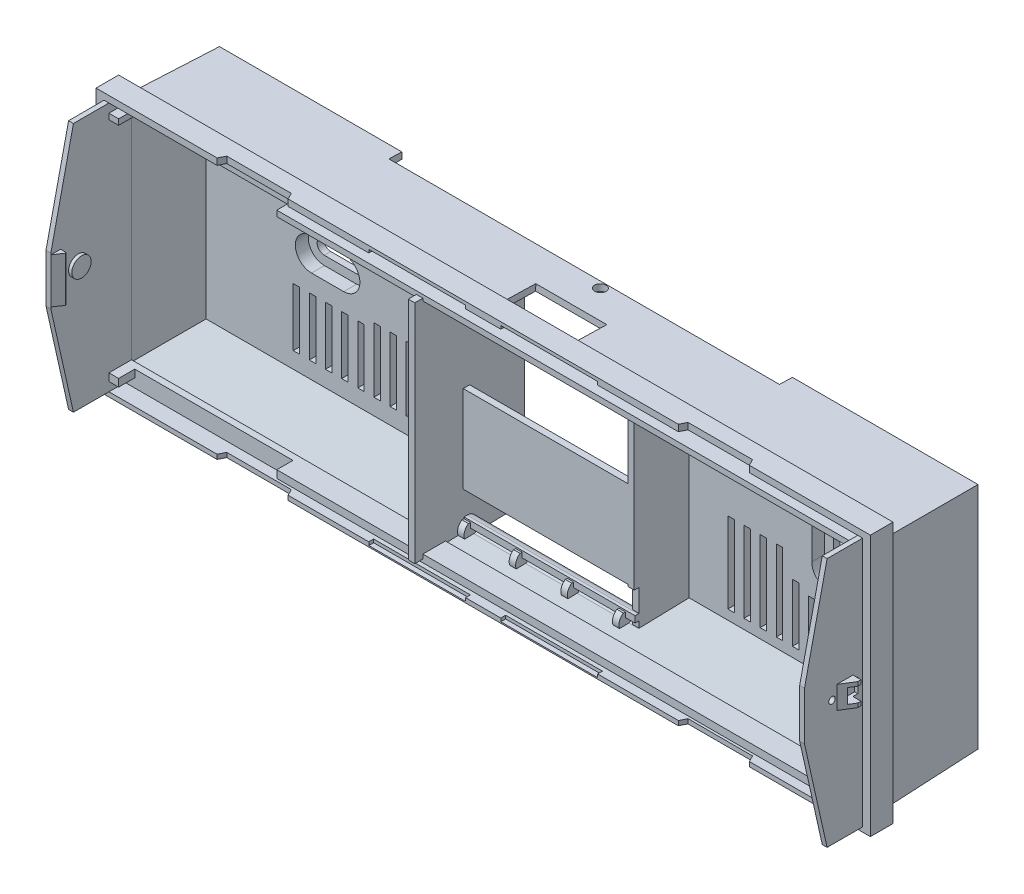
from build123d import *

# Parameters (mm, degrees)
ESQUISSE1_W                   = 235
ESQUISSE1_H                   = 71
EXTRUSION1_DEPTH              = 1.5
EXTRUSION2_START              = 4
ESQUISSE2_W                   = 235
ESQUISSE2_H                   = 71
EXTRUSION2_DEPTH              = 28.5
EXTRUSION2_DRAFT              = 1.5
ESQUISSE3_W                   = 232.49259753
ESQUISSE3_H                   = 68.49259753
ENL_V_MAT_EXTRU_1_DEPTH       = 22.5
ENL_V_MAT_EXTRU_1_DRAFT       = -1.5
ESQUISSE4_W                   = 231
ESQUISSE4_H                   = 67
ENL_V_MAT_EXTRU_2_DEPTH       = 4
ESQUISSE5_W                   = 121
ESQUISSE5_H                   = 4
ENL_V_MAT_EXTRU_3_DEPTH       = 40
ESQUISSE6_W                   = 51
ESQUISSE6_H                   = 69.851042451
ENL_V_MAT_EXTRU_4_DEPTH       = 17
ESQUISSE7_R                   = 1.75
ESQUISSE7_W                   = 22
ESQUISSE7_H                   = 10.5
ENL_V_MAT_EXTRU_5_DEPTH       = 10
EXTRUSION3_DEPTH              = 4
ENL_V_START                   = -2
ENL_V_MAT_EXTRU_6_DEPTH       = 10
ENL_V_MAT_EXTRU_7_DEPTH       = 10
ESQUISSE11_W                  = 2
ESQUISSE11_H                  = 70
EXTRUSION4_DEPTH              = 17
ESQUISSE12_W                  = 2
ESQUISSE12_H                  = 70
EXTRUSION5_DEPTH              = 32
EXTRUSION6_REACH              = 160.252
ESQUISSE13_W                  = 2
ESQUISSE13_H                  = 27
ENL_V_MAT_EXTRU_8_DEPTH       = 10
EXTRUSION7_REACH              = 147.967
EXTRUSION8_DEPTH              = 2
R_P_TITION_LIN_AIRE1_COUNT    = 4
R_P_TITION_LIN_AIRE1_PITCH    = 16
ESQUISSE17_W                  = 239.903414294
ESQUISSE17_H                  = 80.903414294
ESQUISSE17_W_2                = 231.903414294
ESQUISSE17_H_2                = 67.903414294
EXTRUSION9_DEPTH              = 7
ESQUISSE18_W                  = 231.903414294
ESQUISSE18_H                  = 2.75
ENL_V_MAT_EXTRU_9_DEPTH       = 5
ENL_V_START_2                 = -2.5
ENL_V_MAT_EXTRU_10_DEPTH      = 3.5
ESQUISSE20_W                  = 30
ESQUISSE20_H                  = 1
ENL_V_MAT_EXTRU_11_DEPTH      = 1.5
EXTRUSION11_DEPTH             = 1.5
EXTRUSION12_DEPTH             = 7
EXTRUSION13_DEPTH             = 3.5
CONG_1_R                      = 0.2
ENL_V_MAT_EXTRU_12_DEPTH      = 2.25
ESQUISSE26_R                  = 1
ENL_V_MAT_EXTRU_13_DEPTH      = 2
ESQUISSE27_R                  = 3
EXTRUSION14_DEPTH             = 1
CONG_1_OF_SYM_TRIE3_R         = 0.2
ESQUISSE28_W                  = 2
ESQUISSE28_H                  = 20
ESQUISSE28_H_2                = 18
ESQUISSE28_H_3                = 25
ESQUISSE28_H_4                = 16
ESQUISSE28_H_5                = 23
ESQUISSE28_H_6                = 15
ENL_V_MAT_EXTRU_14_DEPTH      = 10
ENL_V_MAT_EXTRU_15_DEPTH      = 38
ENL_V_MAT_EXTRU_15_DEPTH_BACK = 38
ESQUISSE29_W                  = 49
ESQUISSE29_H                  = 5


with BuildPart() as part:
    # Esquisse1 → Extrusion1 (new body)
    with BuildSketch(Plane.XY):
        with Locations((-6.5, 0)):
            Rectangle(ESQUISSE1_W, ESQUISSE1_H)
    extrude(amount=EXTRUSION1_DEPTH)


with BuildPart() as extrusion2_tool:
    # Esquisse2 → Extrusion2 (with draft: the straight prism first)
    with BuildSketch(Plane(origin=(0, 0, 0), x_dir=(-1, 0, 0), z_dir=(0, 0, -1)).offset(EXTRUSION2_START)):
        with Locations((6.5, 0)):
            Rectangle(ESQUISSE2_W, ESQUISSE2_H)
    extrude(amount=-EXTRUSION2_DEPTH)
    # Extrusion2: the draft: its side faces are tilted about the plane it starts from
    extrusion2_sides = [extrusion2_tool.faces().sort_by_distance(p)[0] for p in [
        (111, 0, 10.25),
        (-6.5, -35.5, 10.25),
        (-124, 0, 10.25),
        (-6.5, 35.5, 10.25),
    ]]
    draft(extrusion2_sides, Plane(origin=(0, 0, 0), x_dir=(-1, 0, 0), z_dir=(0, 0, -1)).offset(EXTRUSION2_START), EXTRUSION2_DRAFT)


with BuildPart() as part_1:
    add(part.part)

    # Extrusion2: add extrusion2_tool
    add(extrusion2_tool.part)


with BuildPart() as enl_v_mat_extru_1_tool:
    # Esquisse3 → Enl_v. mat.-Extru.1 (with draft: the straight prism first)
    with BuildSketch(Plane.XY.offset(24.5)):
        with Locations((-6.5, 0)):
            Rectangle(ESQUISSE3_W, ESQUISSE3_H)
    extrude(amount=-ENL_V_MAT_EXTRU_1_DEPTH)
    # Enl_v. mat.-Extru.1: the draft: its side faces are tilted about the plane it starts from
    enl_v_mat_extru_1_sides = [enl_v_mat_extru_1_tool.faces().sort_by_distance(p)[0] for p in [
        (-122.746298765, 0, 13.25),
        (-6.5, -34.246298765, 13.25),
        (109.746298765, 0, 13.25),
        (-6.5, 34.246298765, 13.25),
    ]]
    draft(enl_v_mat_extru_1_sides, Plane.XY.offset(24.5), ENL_V_MAT_EXTRU_1_DRAFT)


with BuildPart() as part_2:
    add(part_1.part)

    # Enl_v. mat.-Extru.1: cut by enl_v_mat_extru_1_tool
    add(enl_v_mat_extru_1_tool.part, mode=Mode.SUBTRACT)

    # Esquisse4 → Enl_v. mat.-Extru.2 (cut)
    with BuildSketch(Plane(origin=(0, 0, -4), x_dir=(-1, 0, 0), z_dir=(0, 0, -1))):
        with Locations((6.5, 0)):
            Rectangle(ESQUISSE4_W, ESQUISSE4_H)
    extrude(amount=-ENL_V_MAT_EXTRU_2_DEPTH, mode=Mode.SUBTRACT)

    # Esquisse5 → Enl_v. mat.-Extru.3 (cut, symmetric)
    with BuildSketch(Plane(origin=(0, 0, 0), x_dir=(1, 0, 0), z_dir=(0, 1, 0))):
        with Locations((-7, 2)):
            Rectangle(ESQUISSE5_W, ESQUISSE5_H)
    extrude(amount=ENL_V_MAT_EXTRU_3_DEPTH, both=True, mode=Mode.SUBTRACT)

    # Esquisse6 → Enl_v. mat.-Extru.4 (cut)
    with BuildSketch(Plane(origin=(0, 0, 0), x_dir=(-1, 0, 0), z_dir=(0, 0, -1))):
        with Locations((0, -1.320777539)):
            Rectangle(ESQUISSE6_W, ESQUISSE6_H)
    extrude(amount=-ENL_V_MAT_EXTRU_4_DEPTH, mode=Mode.SUBTRACT)

    # Esquisse7 → Enl_v. mat.-Extru.5 (cut)
    with BuildSketch(Plane(origin=(0, 35.580346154, -0.931704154), x_dir=(-1, 0, 0), z_dir=(0, 0.9996573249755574, -0.02617694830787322))):
        with Locations(Location((0, 2.932023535, 0), (0, 0, 90))):
            Circle(ESQUISSE7_R)
        with Locations((0, 17.182023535)):
            Rectangle(ESQUISSE7_W, ESQUISSE7_H)
    extrude(amount=-ENL_V_MAT_EXTRU_5_DEPTH, mode=Mode.SUBTRACT)

    # Esquisse8 → Extrusion3 (add)
    with BuildSketch(Plane(origin=(0, 0, 0), x_dir=(-1, 0, 0), z_dir=(0, 0, -1))):
        with BuildLine():
            Line((-78.5, 5), (-78.5, -5))
            ThreePointArc((-78.5, -5), (-70.5, -13), (-62.5, -5))
            Line((-62.5, -5), (-62.5, 5))
            ThreePointArc((-62.5, 5), (-70.5, 13), (-78.5, 5))
        make_face()
        with BuildLine():
            Line((79.5, 8), (89.5, 8))
            ThreePointArc((89.5, 8), (97.5, 0), (89.5, -8))
            Line((89.5, -8), (79.5, -8))
            ThreePointArc((79.5, -8), (71.5, 0), (79.5, 8))
        make_face()
    extrude(amount=EXTRUSION3_DEPTH)

    # Esquisse9 → Enl_v. mat.-Extru.6 (cut)
    with BuildSketch(Plane(origin=(81.698742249, 0.352113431, -4), x_dir=(-1, 0, 0), z_dir=(0, 0, -1)).offset(ENL_V_START)):
        with BuildLine():
            Line((161.198742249, 4.647886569), (171.198742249, 4.647886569))
            ThreePointArc((171.198742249, 4.647886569), (176.198742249, -0.352113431), (171.198742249, -5.352113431))
            Line((171.198742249, -5.352113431), (161.198742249, -5.352113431))
            ThreePointArc((161.198742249, -5.352113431), (156.198742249, -0.352113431), (161.198742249, 4.647886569))
        make_face()
        with BuildLine():
            Line((6.198742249, 4.647886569), (6.198742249, -5.352113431))
            ThreePointArc((6.198742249, -5.352113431), (11.198742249, -10.352113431), (16.198742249, -5.352113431))
            Line((16.198742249, -5.352113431), (16.198742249, 4.647886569))
            ThreePointArc((16.198742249, 4.647886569), (11.198742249, 9.647886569), (6.198742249, 4.647886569))
        make_face()
    extrude(amount=-ENL_V_MAT_EXTRU_6_DEPTH, mode=Mode.SUBTRACT)

    # Esquisse10 → Enl_v. mat.-Extru.7 (cut)
    with BuildSketch(Plane(origin=(0, 0, -4), x_dir=(-1, 0, 0), z_dir=(0, 0, -1))):
        with BuildLine():
            Line((-72.75, 5), (-72.75, -5))
            ThreePointArc((-72.75, -5), (-70.5, -7.25), (-68.25, -5))
            Line((-68.25, -5), (-68.25, 5))
            ThreePointArc((-68.25, 5), (-70.5, 7.25), (-72.75, 5))
        make_face()
        with BuildLine():
            Line((79.5, 2.25), (89.5, 2.25))
            ThreePointArc((89.5, 2.25), (91.75, 0), (89.5, -2.25))
            Line((89.5, -2.25), (79.5, -2.25))
            ThreePointArc((79.5, -2.25), (77.25, 0), (79.5, 2.25))
        make_face()
    extrude(amount=-ENL_V_MAT_EXTRU_7_DEPTH, mode=Mode.SUBTRACT)

    # Esquisse11 → Extrusion4 (add)
    with BuildSketch(Plane.XY.offset(2)):
        with Locations((26.5, 0)):
            Rectangle(ESQUISSE11_W, ESQUISSE11_H)
    extrude(amount=EXTRUSION4_DEPTH)

    # Esquisse12 → Extrusion5 (add)
    with BuildSketch(Plane.XY.offset(2)):
        with Locations((-26.5, 0)):
            Rectangle(ESQUISSE12_W, ESQUISSE12_H)
    extrude(amount=EXTRUSION5_DEPTH)

    # Esquisse13 → Extrusion6 (add, up to next)
    with BuildSketch(Plane.ZY.offset(-25.5), mode=Mode.PRIVATE) as extrusion6_sk1:
        with Locations((18, -9)):
            Rectangle(ESQUISSE13_W, ESQUISSE13_H)
    extrusion6_tool1 = extrude(extrusion6_sk1.sketch, amount=EXTRUSION6_REACH, mode=Mode.PRIVATE) - part_2.part
    add(extrusion6_tool1.solids().sort_by_distance((25.5, -9, 18))[0])

    # Esquisse15 → Enl_v. mat.-Extru.8 (cut)
    with BuildSketch(Plane(origin=(27.5, 0, 0), x_dir=(0, 0, -1), z_dir=(1, 0, 0))):
        Polygon((-17.5, -34.062997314), (-19, -34.102276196), (-19, -23.102276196), (-17.5, -23.102276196), align=None)
    extrude(amount=-ENL_V_MAT_EXTRU_8_DEPTH, mode=Mode.SUBTRACT)

    # Extrusion7: up to this face of the body (flat: up to its plane)
    extrusion7_end = Plane(part_2.part.faces().sort_by_distance((27.5, 0.414758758, 10.406457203))[0])
    # Esquisse14 → Extrusion7 (add, up to the picked face)
    with BuildSketch(Plane(origin=(-25.5, 0, 0), x_dir=(0, 0, -1), z_dir=(1, 0, 0)), mode=Mode.PRIVATE) as extrusion7_sk1:
        with BuildLine():
            Line((-17.75, -34.069543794), (-17.75, -36.069543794))
            ThreePointArc((-17.75, -36.069543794), (-14.75, -33.069543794), (-17.75, -30.069543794))
            Line((-17.75, -30.069543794), (-18.75, -30.069543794))
            Line((-18.75, -30.069543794), (-18.75, -32.069543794))
            Line((-18.75, -32.069543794), (-17.75, -32.069543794))
            ThreePointArc((-17.75, -32.069543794), (-16.75, -33.069543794), (-17.75, -34.069543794))
        make_face()
    extrusion7_tool1 = split(extrude(extrusion7_sk1.sketch, amount=EXTRUSION7_REACH, mode=Mode.PRIVATE), bisect_by=extrusion7_end, keep=Keep.BOTH, mode=Mode.PRIVATE)
    add(extrusion7_tool1.solids().sort_by(Axis((-25.5, -32.794939, 16.628696), (1, 0, 0)))[0])

    # Esquisse16 → Extrusion8 (add)
    with BuildSketch(Plane(origin=(-25.5, 0, 0), x_dir=(0, 0, -1), z_dir=(1, 0, 0))):
        with BuildLine():
            Line((-20.364376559, -34.540949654), (-16.364376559, -34.540949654))
            Line((-16.364376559, -34.540949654), (-16.364376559, -30.540949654))
            Line((-16.364376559, -30.540949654), (-19.364376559, -30.540949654))
            ThreePointArc((-19.364376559, -30.540949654), (-20.6604275, -32.341936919), (-20.364376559, -34.540949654))
        make_face()
    extrusion8 = extrude(amount=EXTRUSION8_DEPTH)

    # R_p_tition lin_aire1: Extrusion8 ×4
    with Locations(*[(i * R_P_TITION_LIN_AIRE1_PITCH, 0, 0) for i in range(1, R_P_TITION_LIN_AIRE1_COUNT)]):
        add(extrusion8)

    # Esquisse17 → Extrusion9 (add)
    with BuildSketch(Plane.XY.offset(24.5)):
        with Locations((-6.794591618, 0.294591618)):
            Rectangle(ESQUISSE17_W, ESQUISSE17_H)
        with Locations((-6.794591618, 0.294591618)):
            Rectangle(ESQUISSE17_W_2, ESQUISSE17_H_2, mode=Mode.SUBTRACT)
    extrude(amount=EXTRUSION9_DEPTH)

    # Esquisse18 → Enl_v. mat.-Extru.9 (cut)
    with BuildSketch(Plane.XY.offset(31.5)):
        with Locations((-6.794591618, 37.371298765)):
            Rectangle(ESQUISSE18_W, ESQUISSE18_H)
        with Locations((-6.794591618, -37.371298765)):
            Rectangle(ESQUISSE18_W, ESQUISSE18_H)
    extrude(amount=-ENL_V_MAT_EXTRU_9_DEPTH, mode=Mode.SUBTRACT)

    # Esquisse19 → Enl_v. mat.-Extru.10 (cut)
    with BuildSketch(Plane.XZ.offset(40.157115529).offset(ENL_V_START_2)):
        Polygon((-67.246298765, 31.5), (-89.246298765, 31.5), (-88.246298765, 29.5), (-68.246298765, 29.5), align=None)
        Polygon((74.657115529, 29.5), (75.657115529, 31.5), (53.657115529, 31.5), (54.657115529, 29.5), align=None)
    enl_v_mat_extru_10 = extrude(amount=ENL_V_MAT_EXTRU_10_DEPTH, mode=Mode.SUBTRACT)

    # Esquisse20 → Enl_v. mat.-Extru.11 (cut)
    with BuildSketch(Plane.XY.offset(31.5)):
        with Locations((-27.246298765, -39.246298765)):
            Rectangle(ESQUISSE20_W, ESQUISSE20_H)
        with Locations((13.657115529, -39.246298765)):
            Rectangle(ESQUISSE20_W, ESQUISSE20_H)
    enl_v_mat_extru_11 = extrude(amount=-ENL_V_MAT_EXTRU_11_DEPTH, mode=Mode.SUBTRACT)

    # Sym_trie1: Enl_v. mat.-Extru.10, Enl_v. mat.-Extru.11 across plane
    add(enl_v_mat_extru_10.mirror(Plane.ZX), mode=Mode.SUBTRACT)
    add(enl_v_mat_extru_11.mirror(Plane.ZX), mode=Mode.SUBTRACT)

    # Esquisse22 → Extrusion11 (add)
    with BuildSketch(Plane(origin=(-122.746298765, 0, 0), x_dir=(0, 0, -1), z_dir=(1, 0, 0))):
        Polygon((-31.5, -38.746298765), (-42.5, -38.746298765), (-49.5, -7.501298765), (-49.5, 7.498701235), (-42.5, 38.746298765), (-31.5, 38.746298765), align=None)
    extrusion11 = extrude(amount=-EXTRUSION11_DEPTH)

    # Esquisse23 → Extrusion12 (add, symmetric)
    with BuildSketch(Plane(origin=(0, 0, 0), x_dir=(1, 0, 0), z_dir=(0, 1, 0))):
        Polygon((-122.746298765, -49.5), (-120.746298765, -46.5), (-122.746298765, -46.5), align=None)
    extrusion12 = extrude(amount=EXTRUSION12_DEPTH, both=True)

    # Esquisse24 → Extrusion13 (add, symmetric)
    with BuildSketch(Plane(origin=(0, 0, 0), x_dir=(1, 0, 0), z_dir=(0, 1, 0))):
        Polygon((-124.246298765, -39.5), (-126.746298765, -35.5), (-126.746298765, -34.5), (-124.246298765, -34.5), align=None)
    extrusion13 = extrude(amount=EXTRUSION13_DEPTH, both=True)

    # Cong_1
    cong_1_edges = [part_2.edges().sort_by_distance(p)[0] for p in [
        (-120.746298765, 0, 46.5),
    ]]
    fillet(cong_1_edges, radius=CONG_1_R)

    # Esquisse25 → Enl_v. mat.-Extru.12 (cut, symmetric)
    with BuildSketch(Plane(origin=(0, 0, 0), x_dir=(1, 0, 0), z_dir=(0, 1, 0))):
        Polygon((-125.496298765, -37.5), (-123.246298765, -36.09375), (-123.246298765, -33), (-127.246298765, -33), (-127.246298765, -37.5), align=None)
    enl_v_mat_extru_12 = extrude(amount=ENL_V_MAT_EXTRU_12_DEPTH, both=True, mode=Mode.SUBTRACT)

    # Esquisse26 → Enl_v. mat.-Extru.13 (cut)
    with BuildSketch(Plane.ZY.offset(124.246298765)):
        with Locations(Location((41.000000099, 0, 0), (0, 0, 270))):
            Circle(ESQUISSE26_R)
    enl_v_mat_extru_13 = extrude(amount=-ENL_V_MAT_EXTRU_13_DEPTH, mode=Mode.SUBTRACT)

    # Esquisse27 → Extrusion14 (add)
    with BuildSketch(Plane(origin=(-122.746298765, 0, 0), x_dir=(0, 0, -1), z_dir=(1, 0, 0))):
        with Locations(Location((-41.000000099, 0, 0), (0, 0, 90))):
            Circle(ESQUISSE27_R)
    extrusion14 = extrude(amount=EXTRUSION14_DEPTH)

    # Sym_trie3: Extrusion11, Extrusion12, Extrusion13, Enl_v. mat.-Extru.12, Enl_v. mat.-Extru.13, Extrusion14 across plane
    add(extrusion11.mirror(Plane.ZY.offset(6.746298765)))
    add(extrusion12.mirror(Plane.ZY.offset(6.746298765)))
    add(extrusion13.mirror(Plane.ZY.offset(6.746298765)))
    add(enl_v_mat_extru_12.mirror(Plane.ZY.offset(6.746298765)), mode=Mode.SUBTRACT)
    add(enl_v_mat_extru_13.mirror(Plane.ZY.offset(6.746298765)), mode=Mode.SUBTRACT)
    add(extrusion14.mirror(Plane.ZY.offset(6.746298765)))

    # Cong_1 of Sym_trie3
    cong_1_of_sym_trie3_edges = [part_2.edges().sort_by_distance(p)[0] for p in [
        (107.253701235, 0, 46.5),
    ]]
    fillet(cong_1_of_sym_trie3_edges, radius=CONG_1_OF_SYM_TRIE3_R)

    # Esquisse28 → Enl_v. mat.-Extru.14 (cut)
    with BuildSketch(Plane.XY.offset(2)):
        with Locations((-94.157115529, 18.657115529)):
            Rectangle(ESQUISSE28_W, ESQUISSE28_H)
        with Locations((-89.157115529, 18.657115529)):
            Rectangle(ESQUISSE28_W, ESQUISSE28_H)
        with Locations((-84.157115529, 18.657115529)):
            Rectangle(ESQUISSE28_W, ESQUISSE28_H)
        with Locations((-79.157115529, 18.657115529)):
            Rectangle(ESQUISSE28_W, ESQUISSE28_H)
        with Locations((-74.157115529, 18.657115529)):
            Rectangle(ESQUISSE28_W, ESQUISSE28_H)
        with Locations((-69.157115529, 18.657115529)):
            Rectangle(ESQUISSE28_W, ESQUISSE28_H)
        with Locations((-64.157115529, 18.657115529)):
            Rectangle(ESQUISSE28_W, ESQUISSE28_H)
        with Locations((-59.157115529, 18.657115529)):
            Rectangle(ESQUISSE28_W, ESQUISSE28_H)
        with Locations((-54.157115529, 18.657115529)):
            Rectangle(ESQUISSE28_W, ESQUISSE28_H)
        with Locations((-54.157115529, -18.657115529)):
            Rectangle(ESQUISSE28_W, ESQUISSE28_H)
        with Locations((-59.157115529, -18.657115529)):
            Rectangle(ESQUISSE28_W, ESQUISSE28_H)
        with Locations((-64.157115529, -18.657115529)):
            Rectangle(ESQUISSE28_W, ESQUISSE28_H)
        with Locations((-69.157115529, -18.657115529)):
            Rectangle(ESQUISSE28_W, ESQUISSE28_H)
        with Locations((-89.157115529, -19.657115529)):
            Rectangle(ESQUISSE28_W, ESQUISSE28_H_2)
        with Locations((-94.157115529, -19.657115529)):
            Rectangle(ESQUISSE28_W, ESQUISSE28_H_2)
        with Locations((-84.157115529, -19.657115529)):
            Rectangle(ESQUISSE28_W, ESQUISSE28_H_2)
        with Locations((-79.157115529, -19.657115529)):
            Rectangle(ESQUISSE28_W, ESQUISSE28_H_2)
        with Locations((-74.157115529, -19.657115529)):
            Rectangle(ESQUISSE28_W, ESQUISSE28_H_2)
        with Locations((40.5, -18.157115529)):
            Rectangle(ESQUISSE28_W, ESQUISSE28_H_3)
        with Locations((45.5, -18.157115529)):
            Rectangle(ESQUISSE28_W, ESQUISSE28_H_3)
        with Locations((50.5, -18.157115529)):
            Rectangle(ESQUISSE28_W, ESQUISSE28_H_3)
        with Locations((55.5, -18.157115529)):
            Rectangle(ESQUISSE28_W, ESQUISSE28_H_3)
        with Locations((60.5, -21.657115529)):
            Rectangle(ESQUISSE28_W, ESQUISSE28_H_2)
        with Locations((65.5, -22.657115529)):
            Rectangle(ESQUISSE28_W, ESQUISSE28_H_4)
        with Locations((70.5, -22.657115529)):
            Rectangle(ESQUISSE28_W, ESQUISSE28_H_4)
        with Locations((75.5, -21.657115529)):
            Rectangle(ESQUISSE28_W, ESQUISSE28_H_2)
        with Locations((80.5, -18.157115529)):
            Rectangle(ESQUISSE28_W, ESQUISSE28_H_3)
        with Locations((80.5, 17.157115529)):
            Rectangle(ESQUISSE28_W, ESQUISSE28_H_5)
        with Locations((70.5, 21.157115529)):
            Rectangle(ESQUISSE28_W, ESQUISSE28_H_6)
        with Locations((75.5, 21.157115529)):
            Rectangle(ESQUISSE28_W, ESQUISSE28_H_6)
        with Locations((65.5, 21.157115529)):
            Rectangle(ESQUISSE28_W, ESQUISSE28_H_6)
        with Locations((60.5, 21.157115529)):
            Rectangle(ESQUISSE28_W, ESQUISSE28_H_6)
        with Locations((50.5, 17.157115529)):
            Rectangle(ESQUISSE28_W, ESQUISSE28_H_5)
        with Locations((55.5, 17.157115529)):
            Rectangle(ESQUISSE28_W, ESQUISSE28_H_5)
        with Locations((45.5, 17.157115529)):
            Rectangle(ESQUISSE28_W, ESQUISSE28_H_5)
        with Locations((40.5, 17.157115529)):
            Rectangle(ESQUISSE28_W, ESQUISSE28_H_5)
    extrude(amount=-ENL_V_MAT_EXTRU_14_DEPTH, mode=Mode.SUBTRACT)

    # Esquisse29 → Enl_v. mat.-Extru.15 (cut, two sides: drawn at the far end of the back side and taken through both)
    with BuildSketch(Plane(origin=(0, 0, 0), x_dir=(1, 0, 0), z_dir=(0, 1, 0)).offset(-ENL_V_MAT_EXTRU_15_DEPTH_BACK)):
        with Locations((-95.246298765, -29)):
            Rectangle(ESQUISSE29_W, ESQUISSE29_H)
    extrude(amount=ENL_V_MAT_EXTRU_15_DEPTH + ENL_V_MAT_EXTRU_15_DEPTH_BACK, mode=Mode.SUBTRACT)


solid = part_2.part
